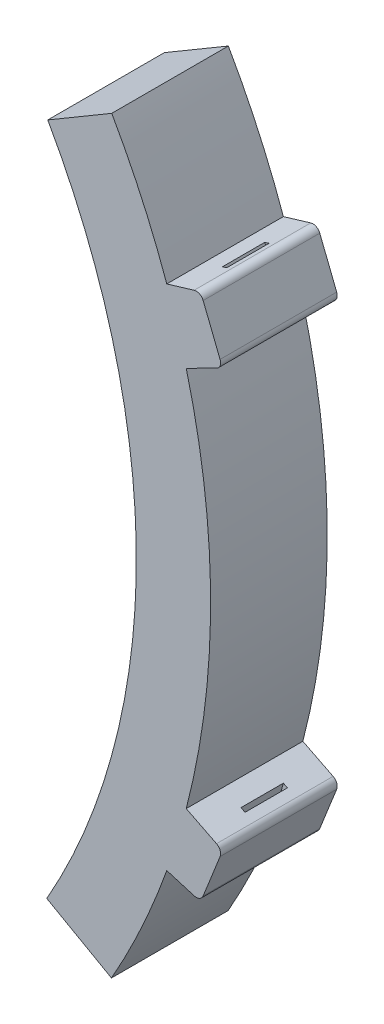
ISO-10303-21;
HEADER;
FILE_DESCRIPTION(('STEP AP214'),'2;1');
FILE_NAME('part.step','',(''),(''),'','','');
FILE_SCHEMA(('AUTOMOTIVE_DESIGN { 1 0 10303 214 1 1 1 1 }'));
ENDSEC;
DATA;
#1=APPLICATION_CONTEXT('core data for automotive mechanical design processes');
#2=APPLICATION_PROTOCOL_DEFINITION('international standard','automotive_design',2000,#1);
#3=PRODUCT_CONTEXT('',#1,'mechanical');
#4=PRODUCT('Part','Part','',(#3));
#5=PRODUCT_RELATED_PRODUCT_CATEGORY('part','',(#4));
#6=PRODUCT_DEFINITION_FORMATION('','',#4);
#7=PRODUCT_DEFINITION_CONTEXT('part definition',#1,'design');
#8=PRODUCT_DEFINITION('design','',#6,#7);
#9=PRODUCT_DEFINITION_SHAPE('','',#8);
#10=(LENGTH_UNIT() NAMED_UNIT(*) SI_UNIT(.MILLI.,.METRE.));
#11=(NAMED_UNIT(*) PLANE_ANGLE_UNIT() SI_UNIT($,.RADIAN.));
#12=(NAMED_UNIT(*) SI_UNIT($,.STERADIAN.) SOLID_ANGLE_UNIT());
#13=UNCERTAINTY_MEASURE_WITH_UNIT(LENGTH_MEASURE(1.E-05),#10,'distance_accuracy_value','');
#14=(GEOMETRIC_REPRESENTATION_CONTEXT(3) GLOBAL_UNCERTAINTY_ASSIGNED_CONTEXT((#13)) GLOBAL_UNIT_ASSIGNED_CONTEXT((#10,
#11,#12)) REPRESENTATION_CONTEXT('',''));
#15=CARTESIAN_POINT('',(0.,0.,0.));
#16=DIRECTION('',(0.,0.,1.));
#17=DIRECTION('',(1.,0.,0.));
#18=AXIS2_PLACEMENT_3D('',#15,#16,#17);
#19=CARTESIAN_POINT('',(-551.829281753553,17.5404044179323,30.634893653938));
#20=DIRECTION('',(0.,0.,-1.));
#21=DIRECTION('',(-1.,0.,0.));
#22=AXIS2_PLACEMENT_3D('',#19,#20,#21);
#23=CYLINDRICAL_SURFACE('',#22,510.);
#24=DIRECTION('',(0.,0.,-1.));
#25=VECTOR('',#24,1.);
#26=CARTESIAN_POINT('',(-58.2453114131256,-110.814043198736,30.634893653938));
#27=LINE('',#26,#25);
#28=CARTESIAN_POINT('',(-58.2453114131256,-110.814043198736,30.634893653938));
#29=VERTEX_POINT('',#28);
#30=CARTESIAN_POINT('',(-58.2453114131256,-110.814043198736,-47.865106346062));
#31=VERTEX_POINT('',#30);
#32=EDGE_CURVE('E313',#29,#31,#27,.T.);
#33=ORIENTED_EDGE('',*,*,#32,.T.);
#34=CARTESIAN_POINT('',(-551.829281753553,17.5404044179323,-47.865106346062));
#35=DIRECTION('',(0.,0.,1.));
#36=DIRECTION('',(1.,0.,0.));
#37=AXIS2_PLACEMENT_3D('',#34,#35,#36);
#38=CIRCLE('',#37,510.);
#39=CARTESIAN_POINT('',(-58.2453114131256,145.8948520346,-47.865106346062));
#40=VERTEX_POINT('',#39);
#41=EDGE_CURVE('E232',#31,#40,#38,.T.);
#42=ORIENTED_EDGE('',*,*,#41,.T.);
#43=DIRECTION('',(0.,0.,-1.));
#44=VECTOR('',#43,1.);
#45=CARTESIAN_POINT('',(-58.2453114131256,145.8948520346,30.634893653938));
#46=LINE('',#45,#44);
#47=CARTESIAN_POINT('',(-58.2453114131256,145.8948520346,30.634893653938));
#48=VERTEX_POINT('',#47);
#49=EDGE_CURVE('E343',#48,#40,#46,.T.);
#50=ORIENTED_EDGE('',*,*,#49,.F.);
#51=CARTESIAN_POINT('',(-551.829281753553,17.5404044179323,30.634893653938));
#52=DIRECTION('',(0.,0.,1.));
#53=DIRECTION('',(1.,0.,0.));
#54=AXIS2_PLACEMENT_3D('',#51,#52,#53);
#55=CIRCLE('',#54,510.);
#56=EDGE_CURVE('E280',#29,#48,#55,.T.);
#57=ORIENTED_EDGE('',*,*,#56,.F.);
#58=EDGE_LOOP('',(#33,#42,#50,#57));
#59=FACE_BOUND('',#58,.T.);
#60=ADVANCED_FACE('F33',(#59),#23,.T.);
#61=CARTESIAN_POINT('',(-37.8615288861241,156.140162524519,30.634893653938));
#62=DIRECTION('',(-0.44908584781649,0.893488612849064,0.));
#63=DIRECTION('',(-0.893488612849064,-0.449085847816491,0.));
#64=AXIS2_PLACEMENT_3D('',#61,#62,#63);
#65=PLANE('',#64);
#66=DIRECTION('',(0.893488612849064,0.449085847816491,0.));
#67=VECTOR('',#66,1.);
#68=CARTESIAN_POINT('',(-37.8615288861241,156.140162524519,5.63489365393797));
#69=LINE('',#68,#67);
#70=CARTESIAN_POINT('',(-46.3725056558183,151.86236965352,5.63489365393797));
#71=VERTEX_POINT('',#70);
#72=CARTESIAN_POINT('',(-43.634493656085,153.238551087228,5.63489365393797));
#73=VERTEX_POINT('',#72);
#74=EDGE_CURVE('E190',#71,#73,#69,.T.);
#75=ORIENTED_EDGE('',*,*,#74,.T.);
#76=DIRECTION('',(0.,0.,-1.));
#77=VECTOR('',#76,1.);
#78=CARTESIAN_POINT('',(-43.6344936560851,153.238551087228,30.634893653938));
#79=LINE('',#78,#77);
#80=CARTESIAN_POINT('',(-43.634493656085,153.238551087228,-22.865106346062));
#81=VERTEX_POINT('',#80);
#82=EDGE_CURVE('E230',#73,#81,#79,.T.);
#83=ORIENTED_EDGE('',*,*,#82,.T.);
#84=DIRECTION('',(-0.893488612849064,-0.449085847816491,0.));
#85=VECTOR('',#84,1.);
#86=CARTESIAN_POINT('',(-37.8615288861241,156.140162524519,-22.865106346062));
#87=LINE('',#86,#85);
#88=CARTESIAN_POINT('',(-46.3725056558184,151.86236965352,-22.865106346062));
#89=VERTEX_POINT('',#88);
#90=EDGE_CURVE('E212',#81,#89,#87,.T.);
#91=ORIENTED_EDGE('',*,*,#90,.T.);
#92=DIRECTION('',(0.,0.,-1.));
#93=VECTOR('',#92,1.);
#94=CARTESIAN_POINT('',(-46.3725056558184,151.86236965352,30.634893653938));
#95=LINE('',#94,#93);
#96=EDGE_CURVE('E201',#89,#71,#95,.F.);
#97=ORIENTED_EDGE('',*,*,#96,.T.);
#98=EDGE_LOOP('',(#75,#83,#91,#97));
#99=FACE_BOUND('',#98,.T.);
#100=ORIENTED_EDGE('',*,*,#49,.T.);
#101=DIRECTION('',(0.893488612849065,0.449085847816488,0.));
#102=VECTOR('',#101,1.);
#103=CARTESIAN_POINT('',(-58.2453114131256,145.8948520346,-47.865106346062));
#104=LINE('',#103,#102);
#105=CARTESIAN_POINT('',(-37.8615288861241,156.140162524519,-47.865106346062));
#106=VERTEX_POINT('',#105);
#107=EDGE_CURVE('E235',#40,#106,#104,.T.);
#108=ORIENTED_EDGE('',*,*,#107,.T.);
#109=DIRECTION('',(0.,0.,-1.));
#110=VECTOR('',#109,1.);
#111=CARTESIAN_POINT('',(-37.8615288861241,156.140162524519,30.634893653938));
#112=LINE('',#111,#110);
#113=CARTESIAN_POINT('',(-37.8615288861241,156.140162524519,30.634893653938));
#114=VERTEX_POINT('',#113);
#115=EDGE_CURVE('E341',#114,#106,#112,.T.);
#116=ORIENTED_EDGE('',*,*,#115,.F.);
#117=DIRECTION('',(0.893488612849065,0.449085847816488,0.));
#118=VECTOR('',#117,1.);
#119=CARTESIAN_POINT('',(-58.2453114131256,145.8948520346,30.634893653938));
#120=LINE('',#119,#118);
#121=EDGE_CURVE('E283',#48,#114,#120,.T.);
#122=ORIENTED_EDGE('',*,*,#121,.F.);
#123=EDGE_LOOP('',(#100,#108,#116,#122));
#124=FACE_BOUND('',#123,.T.);
#125=ADVANCED_FACE('F210',(#99,#124),#65,.F.);
#126=CARTESIAN_POINT('',(-40.1069581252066,160.607605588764,30.634893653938));
#127=DIRECTION('',(0.,0.,-1.));
#128=DIRECTION('',(-1.,0.,0.));
#129=AXIS2_PLACEMENT_3D('',#126,#127,#128);
#130=CYLINDRICAL_SURFACE('',#129,4.99999999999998);
#131=ORIENTED_EDGE('',*,*,#115,.T.);
#132=CARTESIAN_POINT('',(-40.1069581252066,160.607605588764,-47.865106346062));
#133=DIRECTION('',(0.,0.,1.));
#134=DIRECTION('',(1.,0.,0.));
#135=AXIS2_PLACEMENT_3D('',#132,#133,#134);
#136=CIRCLE('',#135,4.99999999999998);
#137=CARTESIAN_POINT('',(-35.4608129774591,162.455126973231,-47.865106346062));
#138=VERTEX_POINT('',#137);
#139=EDGE_CURVE('E238',#106,#138,#136,.T.);
#140=ORIENTED_EDGE('',*,*,#139,.T.);
#141=DIRECTION('',(0.,0.,-1.));
#142=VECTOR('',#141,1.);
#143=CARTESIAN_POINT('',(-35.4608129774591,162.455126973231,30.634893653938));
#144=LINE('',#143,#142);
#145=CARTESIAN_POINT('',(-35.4608129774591,162.455126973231,30.634893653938));
#146=VERTEX_POINT('',#145);
#147=EDGE_CURVE('E339',#146,#138,#144,.T.);
#148=ORIENTED_EDGE('',*,*,#147,.F.);
#149=CARTESIAN_POINT('',(-40.1069581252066,160.607605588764,30.634893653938));
#150=DIRECTION('',(0.,0.,1.));
#151=DIRECTION('',(1.,0.,0.));
#152=AXIS2_PLACEMENT_3D('',#149,#150,#151);
#153=CIRCLE('',#152,4.99999999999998);
#154=EDGE_CURVE('E285',#114,#146,#153,.T.);
#155=ORIENTED_EDGE('',*,*,#154,.F.);
#156=EDGE_LOOP('',(#131,#140,#148,#155));
#157=FACE_BOUND('',#156,.T.);
#158=ADVANCED_FACE('F403',(#157),#130,.T.);
#159=CARTESIAN_POINT('',(-46.8516904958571,191.100895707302,30.634893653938));
#160=DIRECTION('',(-0.929229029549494,-0.369504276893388,0.));
#161=DIRECTION('',(0.369504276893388,-0.929229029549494,0.));
#162=AXIS2_PLACEMENT_3D('',#159,#160,#161);
#163=PLANE('',#162);
#164=ORIENTED_EDGE('',*,*,#147,.T.);
#165=DIRECTION('',(-0.369504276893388,0.929229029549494,0.));
#166=VECTOR('',#165,1.);
#167=CARTESIAN_POINT('',(-46.8516904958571,191.100895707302,-47.865106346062));
#168=LINE('',#167,#166);
#169=CARTESIAN_POINT('',(-46.8516904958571,191.100895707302,-47.865106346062));
#170=VERTEX_POINT('',#169);
#171=EDGE_CURVE('E241',#138,#170,#168,.T.);
#172=ORIENTED_EDGE('',*,*,#171,.T.);
#173=DIRECTION('',(0.,0.,-1.));
#174=VECTOR('',#173,1.);
#175=CARTESIAN_POINT('',(-46.8516904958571,191.100895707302,30.634893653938));
#176=LINE('',#175,#174);
#177=CARTESIAN_POINT('',(-46.8516904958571,191.100895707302,30.634893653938));
#178=VERTEX_POINT('',#177);
#179=EDGE_CURVE('E337',#178,#170,#176,.T.);
#180=ORIENTED_EDGE('',*,*,#179,.F.);
#181=DIRECTION('',(-0.369504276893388,0.929229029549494,0.));
#182=VECTOR('',#181,1.);
#183=CARTESIAN_POINT('',(-46.8516904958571,191.100895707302,30.634893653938));
#184=LINE('',#183,#182);
#185=EDGE_CURVE('E287',#146,#178,#184,.T.);
#186=ORIENTED_EDGE('',*,*,#185,.F.);
#187=EDGE_LOOP('',(#164,#172,#180,#186));
#188=FACE_BOUND('',#187,.T.);
#189=ADVANCED_FACE('F472',(#188),#163,.F.);
#190=CARTESIAN_POINT('',(-51.4978356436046,189.253374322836,30.634893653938));
#191=DIRECTION('',(0.,0.,-1.));
#192=DIRECTION('',(-1.,0.,0.));
#193=AXIS2_PLACEMENT_3D('',#190,#191,#192);
#194=CYLINDRICAL_SURFACE('',#193,5.);
#195=ORIENTED_EDGE('',*,*,#179,.T.);
#196=CARTESIAN_POINT('',(-51.4978356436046,189.253374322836,-47.865106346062));
#197=DIRECTION('',(0.,0.,1.));
#198=DIRECTION('',(1.,0.,0.));
#199=AXIS2_PLACEMENT_3D('',#196,#197,#198);
#200=CIRCLE('',#199,5.);
#201=CARTESIAN_POINT('',(-52.9333884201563,194.042861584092,-47.865106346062));
#202=VERTEX_POINT('',#201);
#203=EDGE_CURVE('E244',#170,#202,#200,.T.);
#204=ORIENTED_EDGE('',*,*,#203,.T.);
#205=DIRECTION('',(0.,0.,-1.));
#206=VECTOR('',#205,1.);
#207=CARTESIAN_POINT('',(-52.9333884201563,194.042861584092,30.634893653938));
#208=LINE('',#207,#206);
#209=CARTESIAN_POINT('',(-52.9333884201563,194.042861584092,30.634893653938));
#210=VERTEX_POINT('',#209);
#211=EDGE_CURVE('E335',#210,#202,#208,.T.);
#212=ORIENTED_EDGE('',*,*,#211,.F.);
#213=CARTESIAN_POINT('',(-51.4978356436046,189.253374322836,30.634893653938));
#214=DIRECTION('',(0.,0.,1.));
#215=DIRECTION('',(1.,0.,0.));
#216=AXIS2_PLACEMENT_3D('',#213,#214,#215);
#217=CIRCLE('',#216,5.);
#218=EDGE_CURVE('E289',#178,#210,#217,.T.);
#219=ORIENTED_EDGE('',*,*,#218,.F.);
#220=EDGE_LOOP('',(#195,#204,#212,#219));
#221=FACE_BOUND('',#220,.T.);
#222=ADVANCED_FACE('F467',(#221),#194,.T.);
#223=CARTESIAN_POINT('',(-59.3568761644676,192.117549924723,30.634893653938));
#224=DIRECTION('',(0.287110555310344,-0.957897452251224,0.));
#225=DIRECTION('',(0.957897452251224,0.287110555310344,0.));
#226=AXIS2_PLACEMENT_3D('',#223,#224,#225);
#227=PLANE('',#226);
#228=DIRECTION('',(0.957897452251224,0.287110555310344,0.));
#229=VECTOR('',#228,1.);
#230=CARTESIAN_POINT('',(-59.3568761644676,192.117549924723,-22.865106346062));
#231=LINE('',#230,#229);
#232=CARTESIAN_POINT('',(-58.8773939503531,192.261265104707,-22.865106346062));
#233=VERTEX_POINT('',#232);
#234=CARTESIAN_POINT('',(-56.0002214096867,193.123639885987,-22.865106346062));
#235=VERTEX_POINT('',#234);
#236=EDGE_CURVE('E216',#233,#235,#231,.T.);
#237=ORIENTED_EDGE('',*,*,#236,.T.);
#238=DIRECTION('',(0.,0.,-1.));
#239=VECTOR('',#238,1.);
#240=CARTESIAN_POINT('',(-56.0002214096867,193.123639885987,30.634893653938));
#241=LINE('',#240,#239);
#242=CARTESIAN_POINT('',(-56.0002214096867,193.123639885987,5.63489365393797));
#243=VERTEX_POINT('',#242);
#244=EDGE_CURVE('E227',#235,#243,#241,.F.);
#245=ORIENTED_EDGE('',*,*,#244,.T.);
#246=DIRECTION('',(-0.957897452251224,-0.287110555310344,0.));
#247=VECTOR('',#246,1.);
#248=CARTESIAN_POINT('',(-59.3568761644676,192.117549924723,5.63489365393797));
#249=LINE('',#248,#247);
#250=CARTESIAN_POINT('',(-58.8773939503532,192.261265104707,5.63489365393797));
#251=VERTEX_POINT('',#250);
#252=EDGE_CURVE('E196',#243,#251,#249,.T.);
#253=ORIENTED_EDGE('',*,*,#252,.T.);
#254=DIRECTION('',(0.,0.,-1.));
#255=VECTOR('',#254,1.);
#256=CARTESIAN_POINT('',(-58.8773939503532,192.261265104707,30.634893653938));
#257=LINE('',#256,#255);
#258=EDGE_CURVE('E204',#251,#233,#257,.T.);
#259=ORIENTED_EDGE('',*,*,#258,.T.);
#260=EDGE_LOOP('',(#237,#245,#253,#259));
#261=FACE_BOUND('',#260,.T.);
#262=ORIENTED_EDGE('',*,*,#211,.T.);
#263=DIRECTION('',(-0.957897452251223,-0.287110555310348,0.));
#264=VECTOR('',#263,1.);
#265=CARTESIAN_POINT('',(-56.4796852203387,192.979930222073,-47.865106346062));
#266=LINE('',#265,#264);
#267=CARTESIAN_POINT('',(-71.3456156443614,188.52416564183,-47.865106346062));
#268=VERTEX_POINT('',#267);
#269=EDGE_CURVE('E247',#202,#268,#266,.T.);
#270=ORIENTED_EDGE('',*,*,#269,.T.);
#271=DIRECTION('',(0.,0.,-1.));
#272=VECTOR('',#271,1.);
#273=CARTESIAN_POINT('',(-71.3456156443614,188.52416564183,30.634893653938));
#274=LINE('',#273,#272);
#275=CARTESIAN_POINT('',(-71.3456156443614,188.52416564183,30.634893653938));
#276=VERTEX_POINT('',#275);
#277=EDGE_CURVE('E333',#276,#268,#274,.T.);
#278=ORIENTED_EDGE('',*,*,#277,.F.);
#279=DIRECTION('',(-0.957897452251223,-0.287110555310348,0.));
#280=VECTOR('',#279,1.);
#281=CARTESIAN_POINT('',(-56.4796852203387,192.979930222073,30.634893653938));
#282=LINE('',#281,#280);
#283=EDGE_CURVE('E291',#210,#276,#282,.T.);
#284=ORIENTED_EDGE('',*,*,#283,.F.);
#285=EDGE_LOOP('',(#262,#270,#278,#284));
#286=FACE_BOUND('',#285,.T.);
#287=ADVANCED_FACE('F463',(#261,#286),#227,.F.);
#288=CARTESIAN_POINT('',(-551.829281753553,17.5404044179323,30.634893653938));
#289=DIRECTION('',(0.,0.,-1.));
#290=DIRECTION('',(-1.,0.,0.));
#291=AXIS2_PLACEMENT_3D('',#288,#289,#290);
#292=CYLINDRICAL_SURFACE('',#291,510.);
#293=ORIENTED_EDGE('',*,*,#277,.T.);
#294=CARTESIAN_POINT('',(-551.829281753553,17.5404044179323,-47.865106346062));
#295=DIRECTION('',(0.,0.,1.));
#296=DIRECTION('',(1.,0.,0.));
#297=AXIS2_PLACEMENT_3D('',#294,#295,#296);
#298=CIRCLE('',#297,510.);
#299=CARTESIAN_POINT('',(-108.390260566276,269.456728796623,-47.865106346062));
#300=VERTEX_POINT('',#299);
#301=EDGE_CURVE('E250',#268,#300,#298,.T.);
#302=ORIENTED_EDGE('',*,*,#301,.T.);
#303=DIRECTION('',(0.,0.,-1.));
#304=VECTOR('',#303,1.);
#305=CARTESIAN_POINT('',(-108.390260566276,269.456728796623,30.634893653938));
#306=LINE('',#305,#304);
#307=CARTESIAN_POINT('',(-108.390260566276,269.456728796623,30.634893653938));
#308=VERTEX_POINT('',#307);
#309=EDGE_CURVE('E331',#308,#300,#306,.T.);
#310=ORIENTED_EDGE('',*,*,#309,.F.);
#311=CARTESIAN_POINT('',(-551.829281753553,17.5404044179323,30.634893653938));
#312=DIRECTION('',(0.,0.,1.));
#313=DIRECTION('',(1.,0.,0.));
#314=AXIS2_PLACEMENT_3D('',#311,#312,#313);
#315=CIRCLE('',#314,510.);
#316=EDGE_CURVE('E293',#276,#308,#315,.T.);
#317=ORIENTED_EDGE('',*,*,#316,.F.);
#318=EDGE_LOOP('',(#293,#302,#310,#317));
#319=FACE_BOUND('',#318,.T.);
#320=ADVANCED_FACE('F458',(#319),#292,.T.);
#321=CARTESIAN_POINT('',(-151.468299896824,244.059905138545,30.634893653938));
#322=DIRECTION('',(0.507863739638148,-0.861437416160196,0.));
#323=DIRECTION('',(0.861437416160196,0.507863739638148,0.));
#324=AXIS2_PLACEMENT_3D('',#321,#322,#323);
#325=PLANE('',#324);
#326=ORIENTED_EDGE('',*,*,#309,.T.);
#327=DIRECTION('',(-0.861437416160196,-0.507863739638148,0.));
#328=VECTOR('',#327,1.);
#329=CARTESIAN_POINT('',(-151.468299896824,244.059905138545,-47.865106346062));
#330=LINE('',#329,#328);
#331=CARTESIAN_POINT('',(-151.468299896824,244.059905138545,-47.865106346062));
#332=VERTEX_POINT('',#331);
#333=EDGE_CURVE('E253',#300,#332,#330,.T.);
#334=ORIENTED_EDGE('',*,*,#333,.T.);
#335=DIRECTION('',(0.,0.,-1.));
#336=VECTOR('',#335,1.);
#337=CARTESIAN_POINT('',(-151.468299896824,244.059905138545,30.634893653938));
#338=LINE('',#337,#336);
#339=CARTESIAN_POINT('',(-151.468299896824,244.059905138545,30.634893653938));
#340=VERTEX_POINT('',#339);
#341=EDGE_CURVE('E329',#340,#332,#338,.T.);
#342=ORIENTED_EDGE('',*,*,#341,.F.);
#343=DIRECTION('',(-0.861437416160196,-0.507863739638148,0.));
#344=VECTOR('',#343,1.);
#345=CARTESIAN_POINT('',(-151.468299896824,244.059905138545,30.634893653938));
#346=LINE('',#345,#344);
#347=EDGE_CURVE('E295',#308,#340,#346,.T.);
#348=ORIENTED_EDGE('',*,*,#347,.F.);
#349=EDGE_LOOP('',(#326,#334,#342,#348));
#350=FACE_BOUND('',#349,.T.);
#351=ADVANCED_FACE('F453',(#350),#325,.F.);
#352=CARTESIAN_POINT('',(-551.829281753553,17.5404044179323,30.634893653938));
#353=DIRECTION('',(0.,0.,-1.));
#354=DIRECTION('',(-1.,0.,0.));
#355=AXIS2_PLACEMENT_3D('',#352,#353,#354);
#356=CYLINDRICAL_SURFACE('',#355,460.);
#357=ORIENTED_EDGE('',*,*,#341,.T.);
#358=CARTESIAN_POINT('',(-551.829281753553,17.5404044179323,-47.865106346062));
#359=DIRECTION('',(0.,0.,-1.));
#360=DIRECTION('',(1.,0.,0.));
#361=AXIS2_PLACEMENT_3D('',#358,#359,#360);
#362=CIRCLE('',#361,460.);
#363=CARTESIAN_POINT('',(-152.119111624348,-210.125534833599,-47.865106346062));
#364=VERTEX_POINT('',#363);
#365=EDGE_CURVE('E256',#332,#364,#362,.T.);
#366=ORIENTED_EDGE('',*,*,#365,.T.);
#367=DIRECTION('',(0.,0.,-1.));
#368=VECTOR('',#367,1.);
#369=CARTESIAN_POINT('',(-152.119111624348,-210.125534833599,30.634893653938));
#370=LINE('',#369,#368);
#371=CARTESIAN_POINT('',(-152.119111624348,-210.125534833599,30.634893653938));
#372=VERTEX_POINT('',#371);
#373=EDGE_CURVE('E327',#372,#364,#370,.T.);
#374=ORIENTED_EDGE('',*,*,#373,.F.);
#375=CARTESIAN_POINT('',(-551.829281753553,17.5404044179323,30.634893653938));
#376=DIRECTION('',(0.,0.,-1.));
#377=DIRECTION('',(1.,0.,0.));
#378=AXIS2_PLACEMENT_3D('',#375,#376,#377);
#379=CIRCLE('',#378,460.);
#380=EDGE_CURVE('E297',#340,#372,#379,.T.);
#381=ORIENTED_EDGE('',*,*,#380,.F.);
#382=EDGE_LOOP('',(#357,#366,#374,#381));
#383=FACE_BOUND('',#382,.T.);
#384=ADVANCED_FACE('F448',(#383),#356,.F.);
#385=CARTESIAN_POINT('',(-152.119111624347,-210.125534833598,30.634893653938));
#386=DIRECTION('',(0.492094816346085,0.8705416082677,0.));
#387=DIRECTION('',(-0.8705416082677,0.492094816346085,0.));
#388=AXIS2_PLACEMENT_3D('',#385,#386,#387);
#389=PLANE('',#388);
#390=ORIENTED_EDGE('',*,*,#373,.T.);
#391=DIRECTION('',(0.8705416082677,-0.492094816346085,0.));
#392=VECTOR('',#391,1.);
#393=CARTESIAN_POINT('',(-152.119111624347,-210.125534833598,-47.865106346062));
#394=LINE('',#393,#392);
#395=CARTESIAN_POINT('',(-108.591823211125,-234.73039322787,-47.865106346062));
#396=VERTEX_POINT('',#395);
#397=EDGE_CURVE('E259',#364,#396,#394,.T.);
#398=ORIENTED_EDGE('',*,*,#397,.T.);
#399=DIRECTION('',(0.,0.,-1.));
#400=VECTOR('',#399,1.);
#401=CARTESIAN_POINT('',(-108.591823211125,-234.73039322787,30.634893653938));
#402=LINE('',#401,#400);
#403=CARTESIAN_POINT('',(-108.591823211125,-234.73039322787,30.634893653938));
#404=VERTEX_POINT('',#403);
#405=EDGE_CURVE('E325',#404,#396,#402,.T.);
#406=ORIENTED_EDGE('',*,*,#405,.F.);
#407=DIRECTION('',(0.8705416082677,-0.492094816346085,0.));
#408=VECTOR('',#407,1.);
#409=CARTESIAN_POINT('',(-152.119111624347,-210.125534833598,30.634893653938));
#410=LINE('',#409,#408);
#411=EDGE_CURVE('E299',#372,#404,#410,.T.);
#412=ORIENTED_EDGE('',*,*,#411,.F.);
#413=EDGE_LOOP('',(#390,#398,#406,#412));
#414=FACE_BOUND('',#413,.T.);
#415=ADVANCED_FACE('F443',(#414),#389,.F.);
#416=CARTESIAN_POINT('',(-551.829281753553,17.5404044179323,30.634893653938));
#417=DIRECTION('',(0.,0.,-1.));
#418=DIRECTION('',(-1.,0.,0.));
#419=AXIS2_PLACEMENT_3D('',#416,#417,#418);
#420=CYLINDRICAL_SURFACE('',#419,510.);
#421=ORIENTED_EDGE('',*,*,#405,.T.);
#422=CARTESIAN_POINT('',(-551.829281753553,17.5404044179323,-47.865106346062));
#423=DIRECTION('',(0.,0.,1.));
#424=DIRECTION('',(1.,0.,0.));
#425=AXIS2_PLACEMENT_3D('',#422,#423,#424);
#426=CIRCLE('',#425,510.);
#427=CARTESIAN_POINT('',(-71.3456156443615,-153.443356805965,-47.865106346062));
#428=VERTEX_POINT('',#427);
#429=EDGE_CURVE('E262',#396,#428,#426,.T.);
#430=ORIENTED_EDGE('',*,*,#429,.T.);
#431=DIRECTION('',(0.,0.,-1.));
#432=VECTOR('',#431,1.);
#433=CARTESIAN_POINT('',(-71.3456156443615,-153.443356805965,30.634893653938));
#434=LINE('',#433,#432);
#435=CARTESIAN_POINT('',(-71.3456156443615,-153.443356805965,30.634893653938));
#436=VERTEX_POINT('',#435);
#437=EDGE_CURVE('E323',#436,#428,#434,.T.);
#438=ORIENTED_EDGE('',*,*,#437,.F.);
#439=CARTESIAN_POINT('',(-551.829281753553,17.5404044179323,30.634893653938));
#440=DIRECTION('',(0.,0.,1.));
#441=DIRECTION('',(1.,0.,0.));
#442=AXIS2_PLACEMENT_3D('',#439,#440,#441);
#443=CIRCLE('',#442,510.);
#444=EDGE_CURVE('E301',#404,#436,#443,.T.);
#445=ORIENTED_EDGE('',*,*,#444,.F.);
#446=EDGE_LOOP('',(#421,#430,#438,#445));
#447=FACE_BOUND('',#446,.T.);
#448=ADVANCED_FACE('F437',(#447),#420,.T.);
#449=CARTESIAN_POINT('',(-56.4796852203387,-157.899121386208,30.634893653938));
#450=DIRECTION('',(0.287110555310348,0.957897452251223,0.));
#451=DIRECTION('',(-0.957897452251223,0.287110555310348,0.));
#452=AXIS2_PLACEMENT_3D('',#449,#450,#451);
#453=PLANE('',#452);
#454=DIRECTION('',(0.957897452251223,-0.287110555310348,0.));
#455=VECTOR('',#454,1.);
#456=CARTESIAN_POINT('',(-56.4796852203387,-157.899121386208,5.63489365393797));
#457=LINE('',#456,#455);
#458=CARTESIAN_POINT('',(-58.8773939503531,-157.180456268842,5.63489365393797));
#459=VERTEX_POINT('',#458);
#460=CARTESIAN_POINT('',(-56.0002214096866,-158.042831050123,5.63489365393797));
#461=VERTEX_POINT('',#460);
#462=EDGE_CURVE('E373',#459,#461,#457,.T.);
#463=ORIENTED_EDGE('',*,*,#462,.T.);
#464=DIRECTION('',(0.,0.,-1.));
#465=VECTOR('',#464,1.);
#466=CARTESIAN_POINT('',(-56.0002214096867,-158.042831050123,30.634893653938));
#467=LINE('',#466,#465);
#468=CARTESIAN_POINT('',(-56.0002214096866,-158.042831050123,-22.865106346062));
#469=VERTEX_POINT('',#468);
#470=EDGE_CURVE('E224',#461,#469,#467,.T.);
#471=ORIENTED_EDGE('',*,*,#470,.T.);
#472=DIRECTION('',(-0.957897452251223,0.287110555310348,0.));
#473=VECTOR('',#472,1.);
#474=CARTESIAN_POINT('',(-56.4796852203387,-157.899121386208,-22.865106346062));
#475=LINE('',#474,#473);
#476=CARTESIAN_POINT('',(-58.8773939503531,-157.180456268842,-22.865106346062));
#477=VERTEX_POINT('',#476);
#478=EDGE_CURVE('E213',#469,#477,#475,.T.);
#479=ORIENTED_EDGE('',*,*,#478,.T.);
#480=DIRECTION('',(0.,0.,-1.));
#481=VECTOR('',#480,1.);
#482=CARTESIAN_POINT('',(-58.8773939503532,-157.180456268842,30.634893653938));
#483=LINE('',#482,#481);
#484=EDGE_CURVE('E195',#477,#459,#483,.F.);
#485=ORIENTED_EDGE('',*,*,#484,.T.);
#486=EDGE_LOOP('',(#463,#471,#479,#485));
#487=FACE_BOUND('',#486,.T.);
#488=ORIENTED_EDGE('',*,*,#437,.T.);
#489=DIRECTION('',(0.957897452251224,-0.287110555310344,0.));
#490=VECTOR('',#489,1.);
#491=CARTESIAN_POINT('',(-59.3568761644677,-157.036741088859,-47.865106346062));
#492=LINE('',#491,#490);
#493=CARTESIAN_POINT('',(-52.9333884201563,-158.962052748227,-47.865106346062));
#494=VERTEX_POINT('',#493);
#495=EDGE_CURVE('E265',#428,#494,#492,.T.);
#496=ORIENTED_EDGE('',*,*,#495,.T.);
#497=DIRECTION('',(0.,0.,-1.));
#498=VECTOR('',#497,1.);
#499=CARTESIAN_POINT('',(-52.9333884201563,-158.962052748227,30.634893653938));
#500=LINE('',#499,#498);
#501=CARTESIAN_POINT('',(-52.9333884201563,-158.962052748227,30.634893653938));
#502=VERTEX_POINT('',#501);
#503=EDGE_CURVE('E321',#502,#494,#500,.T.);
#504=ORIENTED_EDGE('',*,*,#503,.F.);
#505=DIRECTION('',(0.957897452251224,-0.287110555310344,0.));
#506=VECTOR('',#505,1.);
#507=CARTESIAN_POINT('',(-59.3568761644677,-157.036741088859,30.634893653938));
#508=LINE('',#507,#506);
#509=EDGE_CURVE('E303',#436,#502,#508,.T.);
#510=ORIENTED_EDGE('',*,*,#509,.F.);
#511=EDGE_LOOP('',(#488,#496,#504,#510));
#512=FACE_BOUND('',#511,.T.);
#513=ADVANCED_FACE('F377',(#487,#512),#453,.F.);
#514=CARTESIAN_POINT('',(-51.4978356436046,-154.172565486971,30.634893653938));
#515=DIRECTION('',(0.,0.,-1.));
#516=DIRECTION('',(-1.,0.,0.));
#517=AXIS2_PLACEMENT_3D('',#514,#515,#516);
#518=CYLINDRICAL_SURFACE('',#517,5.);
#519=ORIENTED_EDGE('',*,*,#503,.T.);
#520=CARTESIAN_POINT('',(-51.4978356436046,-154.172565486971,-47.865106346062));
#521=DIRECTION('',(0.,0.,1.));
#522=DIRECTION('',(1.,0.,0.));
#523=AXIS2_PLACEMENT_3D('',#520,#521,#522);
#524=CIRCLE('',#523,5.);
#525=CARTESIAN_POINT('',(-46.8516904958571,-156.020086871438,-47.865106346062));
#526=VERTEX_POINT('',#525);
#527=EDGE_CURVE('E268',#494,#526,#524,.T.);
#528=ORIENTED_EDGE('',*,*,#527,.T.);
#529=DIRECTION('',(0.,0.,-1.));
#530=VECTOR('',#529,1.);
#531=CARTESIAN_POINT('',(-46.8516904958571,-156.020086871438,30.634893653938));
#532=LINE('',#531,#530);
#533=CARTESIAN_POINT('',(-46.8516904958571,-156.020086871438,30.634893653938));
#534=VERTEX_POINT('',#533);
#535=EDGE_CURVE('E319',#534,#526,#532,.T.);
#536=ORIENTED_EDGE('',*,*,#535,.F.);
#537=CARTESIAN_POINT('',(-51.4978356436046,-154.172565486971,30.634893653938));
#538=DIRECTION('',(0.,0.,1.));
#539=DIRECTION('',(1.,0.,0.));
#540=AXIS2_PLACEMENT_3D('',#537,#538,#539);
#541=CIRCLE('',#540,5.);
#542=EDGE_CURVE('E305',#502,#534,#541,.T.);
#543=ORIENTED_EDGE('',*,*,#542,.F.);
#544=EDGE_LOOP('',(#519,#528,#536,#543));
#545=FACE_BOUND('',#544,.T.);
#546=ADVANCED_FACE('F430',(#545),#518,.T.);
#547=CARTESIAN_POINT('',(-46.8516904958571,-156.020086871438,30.634893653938));
#548=DIRECTION('',(-0.929229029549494,0.369504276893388,0.));
#549=DIRECTION('',(-0.369504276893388,-0.929229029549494,0.));
#550=AXIS2_PLACEMENT_3D('',#547,#548,#549);
#551=PLANE('',#550);
#552=ORIENTED_EDGE('',*,*,#535,.T.);
#553=DIRECTION('',(0.369504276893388,0.929229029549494,0.));
#554=VECTOR('',#553,1.);
#555=CARTESIAN_POINT('',(-46.8516904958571,-156.020086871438,-47.865106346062));
#556=LINE('',#555,#554);
#557=CARTESIAN_POINT('',(-35.4608129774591,-127.374318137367,-47.865106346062));
#558=VERTEX_POINT('',#557);
#559=EDGE_CURVE('E271',#526,#558,#556,.T.);
#560=ORIENTED_EDGE('',*,*,#559,.T.);
#561=DIRECTION('',(0.,0.,-1.));
#562=VECTOR('',#561,1.);
#563=CARTESIAN_POINT('',(-35.4608129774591,-127.374318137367,30.634893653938));
#564=LINE('',#563,#562);
#565=CARTESIAN_POINT('',(-35.4608129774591,-127.374318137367,30.634893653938));
#566=VERTEX_POINT('',#565);
#567=EDGE_CURVE('E317',#566,#558,#564,.T.);
#568=ORIENTED_EDGE('',*,*,#567,.F.);
#569=DIRECTION('',(0.369504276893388,0.929229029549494,0.));
#570=VECTOR('',#569,1.);
#571=CARTESIAN_POINT('',(-46.8516904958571,-156.020086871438,30.634893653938));
#572=LINE('',#571,#570);
#573=EDGE_CURVE('E307',#534,#566,#572,.T.);
#574=ORIENTED_EDGE('',*,*,#573,.F.);
#575=EDGE_LOOP('',(#552,#560,#568,#574));
#576=FACE_BOUND('',#575,.T.);
#577=ADVANCED_FACE('F426',(#576),#551,.F.);
#578=CARTESIAN_POINT('',(-40.1069581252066,-125.5267967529,30.634893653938));
#579=DIRECTION('',(0.,0.,-1.));
#580=DIRECTION('',(-1.,0.,0.));
#581=AXIS2_PLACEMENT_3D('',#578,#579,#580);
#582=CYLINDRICAL_SURFACE('',#581,4.99999999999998);
#583=ORIENTED_EDGE('',*,*,#567,.T.);
#584=CARTESIAN_POINT('',(-40.1069581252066,-125.5267967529,-47.865106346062));
#585=DIRECTION('',(0.,0.,1.));
#586=DIRECTION('',(1.,0.,0.));
#587=AXIS2_PLACEMENT_3D('',#584,#585,#586);
#588=CIRCLE('',#587,4.99999999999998);
#589=CARTESIAN_POINT('',(-37.8615288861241,-121.059353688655,-47.865106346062));
#590=VERTEX_POINT('',#589);
#591=EDGE_CURVE('E274',#558,#590,#588,.T.);
#592=ORIENTED_EDGE('',*,*,#591,.T.);
#593=DIRECTION('',(0.,0.,-1.));
#594=VECTOR('',#593,1.);
#595=CARTESIAN_POINT('',(-37.8615288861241,-121.059353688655,30.634893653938));
#596=LINE('',#595,#594);
#597=CARTESIAN_POINT('',(-37.8615288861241,-121.059353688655,30.634893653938));
#598=VERTEX_POINT('',#597);
#599=EDGE_CURVE('E315',#598,#590,#596,.T.);
#600=ORIENTED_EDGE('',*,*,#599,.F.);
#601=CARTESIAN_POINT('',(-40.1069581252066,-125.5267967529,30.634893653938));
#602=DIRECTION('',(0.,0.,1.));
#603=DIRECTION('',(1.,0.,0.));
#604=AXIS2_PLACEMENT_3D('',#601,#602,#603);
#605=CIRCLE('',#604,4.99999999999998);
#606=EDGE_CURVE('E309',#566,#598,#605,.T.);
#607=ORIENTED_EDGE('',*,*,#606,.F.);
#608=EDGE_LOOP('',(#583,#592,#600,#607));
#609=FACE_BOUND('',#608,.T.);
#610=ADVANCED_FACE('F422',(#609),#582,.T.);
#611=CARTESIAN_POINT('',(-58.2453114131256,-110.814043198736,30.634893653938));
#612=DIRECTION('',(-0.44908584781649,-0.893488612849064,0.));
#613=DIRECTION('',(0.893488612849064,-0.44908584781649,0.));
#614=AXIS2_PLACEMENT_3D('',#611,#612,#613);
#615=PLANE('',#614);
#616=DIRECTION('',(0.893488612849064,-0.44908584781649,0.));
#617=VECTOR('',#616,1.);
#618=CARTESIAN_POINT('',(-58.2453114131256,-110.814043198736,-22.865106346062));
#619=LINE('',#618,#617);
#620=CARTESIAN_POINT('',(-46.3725056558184,-116.781560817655,-22.865106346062));
#621=VERTEX_POINT('',#620);
#622=CARTESIAN_POINT('',(-43.634493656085,-118.157742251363,-22.865106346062));
#623=VERTEX_POINT('',#622);
#624=EDGE_CURVE('E40',#621,#623,#619,.T.);
#625=ORIENTED_EDGE('',*,*,#624,.T.);
#626=DIRECTION('',(0.,0.,-1.));
#627=VECTOR('',#626,1.);
#628=CARTESIAN_POINT('',(-43.6344936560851,-118.157742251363,30.634893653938));
#629=LINE('',#628,#627);
#630=CARTESIAN_POINT('',(-43.634493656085,-118.157742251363,5.63489365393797));
#631=VERTEX_POINT('',#630);
#632=EDGE_CURVE('E11',#623,#631,#629,.F.);
#633=ORIENTED_EDGE('',*,*,#632,.T.);
#634=DIRECTION('',(-0.893488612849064,0.44908584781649,0.));
#635=VECTOR('',#634,1.);
#636=CARTESIAN_POINT('',(-58.2453114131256,-110.814043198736,5.63489365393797));
#637=LINE('',#636,#635);
#638=CARTESIAN_POINT('',(-46.3725056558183,-116.781560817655,5.63489365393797));
#639=VERTEX_POINT('',#638);
#640=EDGE_CURVE('E345',#631,#639,#637,.T.);
#641=ORIENTED_EDGE('',*,*,#640,.T.);
#642=DIRECTION('',(0.,0.,-1.));
#643=VECTOR('',#642,1.);
#644=CARTESIAN_POINT('',(-46.3725056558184,-116.781560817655,30.634893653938));
#645=LINE('',#644,#643);
#646=EDGE_CURVE('E348',#639,#621,#645,.T.);
#647=ORIENTED_EDGE('',*,*,#646,.T.);
#648=EDGE_LOOP('',(#625,#633,#641,#647));
#649=FACE_BOUND('',#648,.T.);
#650=ORIENTED_EDGE('',*,*,#599,.T.);
#651=DIRECTION('',(-0.893488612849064,0.44908584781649,0.));
#652=VECTOR('',#651,1.);
#653=CARTESIAN_POINT('',(-37.8615288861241,-121.059353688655,-47.865106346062));
#654=LINE('',#653,#652);
#655=EDGE_CURVE('E277',#590,#31,#654,.T.);
#656=ORIENTED_EDGE('',*,*,#655,.T.);
#657=ORIENTED_EDGE('',*,*,#32,.F.);
#658=DIRECTION('',(-0.893488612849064,0.44908584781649,0.));
#659=VECTOR('',#658,1.);
#660=CARTESIAN_POINT('',(-37.8615288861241,-121.059353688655,30.634893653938));
#661=LINE('',#660,#659);
#662=EDGE_CURVE('E311',#598,#29,#661,.T.);
#663=ORIENTED_EDGE('',*,*,#662,.F.);
#664=EDGE_LOOP('',(#650,#656,#657,#663));
#665=FACE_BOUND('',#664,.T.);
#666=ADVANCED_FACE('F352',(#649,#665),#615,.F.);
#667=CARTESIAN_POINT('',(-551.829281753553,17.5404044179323,30.634893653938));
#668=DIRECTION('',(0.,0.,1.));
#669=DIRECTION('',(1.,0.,0.));
#670=AXIS2_PLACEMENT_3D('',#667,#668,#669);
#671=PLANE('',#670);
#672=ORIENTED_EDGE('',*,*,#56,.T.);
#673=ORIENTED_EDGE('',*,*,#121,.T.);
#674=ORIENTED_EDGE('',*,*,#154,.T.);
#675=ORIENTED_EDGE('',*,*,#185,.T.);
#676=ORIENTED_EDGE('',*,*,#218,.T.);
#677=ORIENTED_EDGE('',*,*,#283,.T.);
#678=ORIENTED_EDGE('',*,*,#316,.T.);
#679=ORIENTED_EDGE('',*,*,#347,.T.);
#680=ORIENTED_EDGE('',*,*,#380,.T.);
#681=ORIENTED_EDGE('',*,*,#411,.T.);
#682=ORIENTED_EDGE('',*,*,#444,.T.);
#683=ORIENTED_EDGE('',*,*,#509,.T.);
#684=ORIENTED_EDGE('',*,*,#542,.T.);
#685=ORIENTED_EDGE('',*,*,#573,.T.);
#686=ORIENTED_EDGE('',*,*,#606,.T.);
#687=ORIENTED_EDGE('',*,*,#662,.T.);
#688=EDGE_LOOP('',(#672,#673,#674,#675,#676,#677,#678,#679,#680,#681,#682,#683,#684,#685,#686,#687));
#689=FACE_BOUND('',#688,.T.);
#690=ADVANCED_FACE('F394',(#689),#671,.T.);
#691=CARTESIAN_POINT('',(-551.829281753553,17.5404044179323,-47.865106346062));
#692=DIRECTION('',(0.,0.,1.));
#693=DIRECTION('',(1.,0.,0.));
#694=AXIS2_PLACEMENT_3D('',#691,#692,#693);
#695=PLANE('',#694);
#696=ORIENTED_EDGE('',*,*,#41,.F.);
#697=ORIENTED_EDGE('',*,*,#655,.F.);
#698=ORIENTED_EDGE('',*,*,#591,.F.);
#699=ORIENTED_EDGE('',*,*,#559,.F.);
#700=ORIENTED_EDGE('',*,*,#527,.F.);
#701=ORIENTED_EDGE('',*,*,#495,.F.);
#702=ORIENTED_EDGE('',*,*,#429,.F.);
#703=ORIENTED_EDGE('',*,*,#397,.F.);
#704=ORIENTED_EDGE('',*,*,#365,.F.);
#705=ORIENTED_EDGE('',*,*,#333,.F.);
#706=ORIENTED_EDGE('',*,*,#301,.F.);
#707=ORIENTED_EDGE('',*,*,#269,.F.);
#708=ORIENTED_EDGE('',*,*,#203,.F.);
#709=ORIENTED_EDGE('',*,*,#171,.F.);
#710=ORIENTED_EDGE('',*,*,#139,.F.);
#711=ORIENTED_EDGE('',*,*,#107,.F.);
#712=EDGE_LOOP('',(#696,#697,#698,#699,#700,#701,#702,#703,#704,#705,#706,#707,#708,#709,#710,#711));
#713=FACE_BOUND('',#712,.T.);
#714=ADVANCED_FACE('F387',(#713),#695,.F.);
#715=CARTESIAN_POINT('',(-94.6631574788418,-242.603910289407,5.63489365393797));
#716=DIRECTION('',(0.,0.,1.));
#717=DIRECTION('',(1.,0.,0.));
#718=AXIS2_PLACEMENT_3D('',#715,#716,#717);
#719=PLANE('',#718);
#720=CARTESIAN_POINT('',(-551.829281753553,17.5404044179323,5.63489365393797));
#721=DIRECTION('',(0.,0.,-1.));
#722=DIRECTION('',(-1.,0.,0.));
#723=AXIS2_PLACEMENT_3D('',#720,#721,#722);
#724=CIRCLE('',#723,522.999945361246);
#725=EDGE_CURVE('E207',#639,#459,#724,.T.);
#726=ORIENTED_EDGE('',*,*,#725,.F.);
#727=ORIENTED_EDGE('',*,*,#640,.F.);
#728=CARTESIAN_POINT('',(-551.829281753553,17.5404044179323,5.63489365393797));
#729=DIRECTION('',(0.,0.,-1.));
#730=DIRECTION('',(-1.,0.,0.));
#731=AXIS2_PLACEMENT_3D('',#728,#729,#730);
#732=CIRCLE('',#731,525.999933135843);
#733=EDGE_CURVE('E383',#631,#461,#732,.T.);
#734=ORIENTED_EDGE('',*,*,#733,.T.);
#735=ORIENTED_EDGE('',*,*,#462,.F.);
#736=EDGE_LOOP('',(#726,#727,#734,#735));
#737=FACE_BOUND('',#736,.T.);
#738=ADVANCED_FACE('F385',(#737),#719,.F.);
#739=CARTESIAN_POINT('',(-551.829281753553,17.5404044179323,30.634893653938));
#740=DIRECTION('',(0.,0.,-1.));
#741=DIRECTION('',(-1.,0.,0.));
#742=AXIS2_PLACEMENT_3D('',#739,#740,#741);
#743=CYLINDRICAL_SURFACE('',#742,522.999945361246);
#744=CARTESIAN_POINT('',(-551.829281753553,17.5404044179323,-22.865106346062));
#745=DIRECTION('',(0.,0.,-1.));
#746=DIRECTION('',(-1.,0.,0.));
#747=AXIS2_PLACEMENT_3D('',#744,#745,#746);
#748=CIRCLE('',#747,522.999945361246);
#749=EDGE_CURVE('E206',#621,#477,#748,.T.);
#750=ORIENTED_EDGE('',*,*,#749,.F.);
#751=ORIENTED_EDGE('',*,*,#646,.F.);
#752=ORIENTED_EDGE('',*,*,#725,.T.);
#753=ORIENTED_EDGE('',*,*,#484,.F.);
#754=EDGE_LOOP('',(#750,#751,#752,#753));
#755=FACE_BOUND('',#754,.T.);
#756=ADVANCED_FACE('F363',(#755),#743,.T.);
#757=CARTESIAN_POINT('',(-94.6631574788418,-242.603910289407,-22.865106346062));
#758=DIRECTION('',(0.,0.,-1.));
#759=DIRECTION('',(-1.,0.,0.));
#760=AXIS2_PLACEMENT_3D('',#757,#758,#759);
#761=PLANE('',#760);
#762=CARTESIAN_POINT('',(-551.829281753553,17.5404044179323,-22.865106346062));
#763=DIRECTION('',(0.,0.,-1.));
#764=DIRECTION('',(-1.,0.,0.));
#765=AXIS2_PLACEMENT_3D('',#762,#763,#764);
#766=CIRCLE('',#765,525.999933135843);
#767=EDGE_CURVE('E361',#623,#469,#766,.T.);
#768=ORIENTED_EDGE('',*,*,#767,.F.);
#769=ORIENTED_EDGE('',*,*,#624,.F.);
#770=ORIENTED_EDGE('',*,*,#749,.T.);
#771=ORIENTED_EDGE('',*,*,#478,.F.);
#772=EDGE_LOOP('',(#768,#769,#770,#771));
#773=FACE_BOUND('',#772,.T.);
#774=ADVANCED_FACE('F359',(#773),#761,.F.);
#775=CARTESIAN_POINT('',(-551.829281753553,17.5404044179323,30.634893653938));
#776=DIRECTION('',(0.,0.,-1.));
#777=DIRECTION('',(-1.,0.,0.));
#778=AXIS2_PLACEMENT_3D('',#775,#776,#777);
#779=CYLINDRICAL_SURFACE('',#778,525.999933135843);
#780=ORIENTED_EDGE('',*,*,#733,.F.);
#781=ORIENTED_EDGE('',*,*,#632,.F.);
#782=ORIENTED_EDGE('',*,*,#767,.T.);
#783=ORIENTED_EDGE('',*,*,#470,.F.);
#784=EDGE_LOOP('',(#780,#781,#782,#783));
#785=FACE_BOUND('',#784,.T.);
#786=ADVANCED_FACE('F382',(#785),#779,.F.);
#787=EDGE_CURVE('E47',#243,#73,#732,.T.);
#788=ORIENTED_EDGE('',*,*,#787,.F.);
#789=ORIENTED_EDGE('',*,*,#244,.F.);
#790=EDGE_CURVE('E370',#235,#81,#766,.T.);
#791=ORIENTED_EDGE('',*,*,#790,.T.);
#792=ORIENTED_EDGE('',*,*,#82,.F.);
#793=EDGE_LOOP('',(#788,#789,#791,#792));
#794=FACE_BOUND('',#793,.T.);
#795=ADVANCED_FACE('F641',(#794),#779,.F.);
#796=ORIENTED_EDGE('',*,*,#790,.F.);
#797=ORIENTED_EDGE('',*,*,#236,.F.);
#798=EDGE_CURVE('E366',#233,#89,#748,.T.);
#799=ORIENTED_EDGE('',*,*,#798,.T.);
#800=ORIENTED_EDGE('',*,*,#90,.F.);
#801=EDGE_LOOP('',(#796,#797,#799,#800));
#802=FACE_BOUND('',#801,.T.);
#803=ADVANCED_FACE('F634',(#802),#761,.F.);
#804=ORIENTED_EDGE('',*,*,#798,.F.);
#805=ORIENTED_EDGE('',*,*,#258,.F.);
#806=EDGE_CURVE('E52',#251,#71,#724,.T.);
#807=ORIENTED_EDGE('',*,*,#806,.T.);
#808=ORIENTED_EDGE('',*,*,#96,.F.);
#809=EDGE_LOOP('',(#804,#805,#807,#808));
#810=FACE_BOUND('',#809,.T.);
#811=ADVANCED_FACE('F200',(#810),#743,.T.);
#812=ORIENTED_EDGE('',*,*,#806,.F.);
#813=ORIENTED_EDGE('',*,*,#252,.F.);
#814=ORIENTED_EDGE('',*,*,#787,.T.);
#815=ORIENTED_EDGE('',*,*,#74,.F.);
#816=EDGE_LOOP('',(#812,#813,#814,#815));
#817=FACE_BOUND('',#816,.T.);
#818=ADVANCED_FACE('F191',(#817),#719,.F.);
#819=CLOSED_SHELL('',(#60,#125,#158,#189,#222,#287,#320,#351,#384,#415,#448,#513,#546,#577,#610,
#666,#690,#714,#738,#756,#774,#786,#795,#803,#811,#818));
#820=MANIFOLD_SOLID_BREP('B2',#819);
#821=ADVANCED_BREP_SHAPE_REPRESENTATION('',(#18,#820),#14);
#822=SHAPE_DEFINITION_REPRESENTATION(#9,#821);
ENDSEC;
END-ISO-10303-21;
